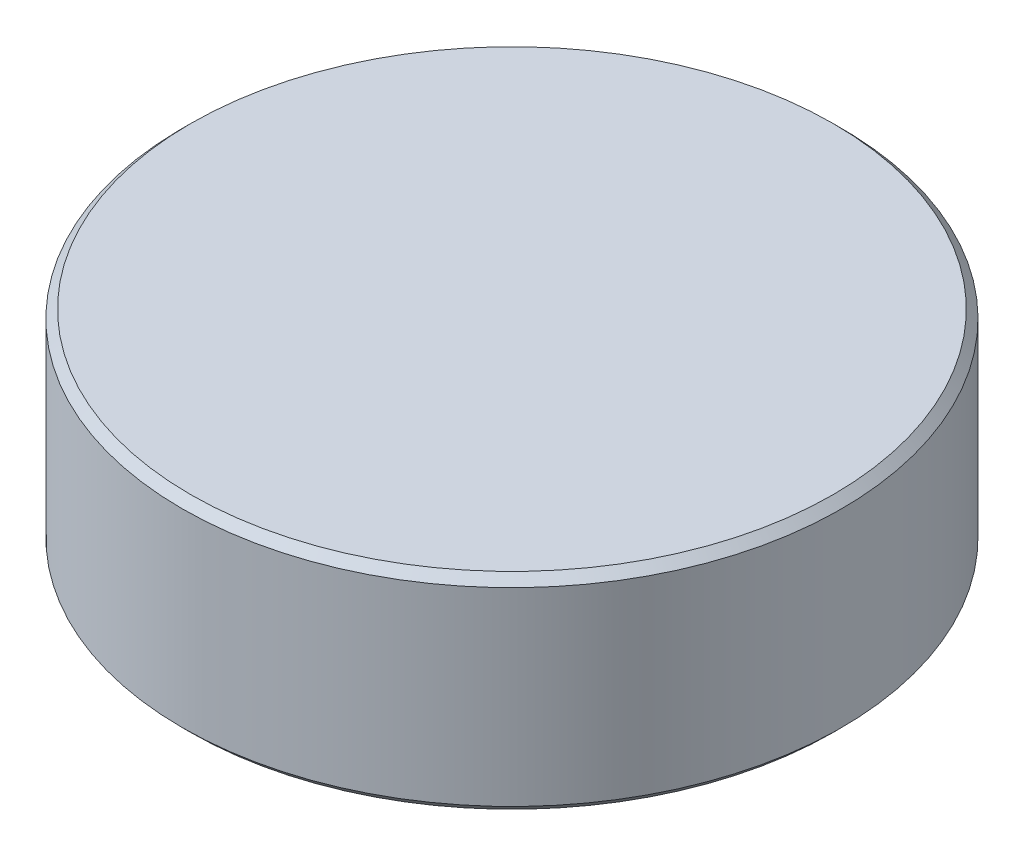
from build123d import *

# Parameters (mm, degrees)
SKETCH1_R      = 50.8
EXTRUDE1_DEPTH = 31.75
CHAMFER1_SIZE  = 1.27


with BuildPart() as part:
    # Sketch1 → Extrude1 (new body)
    with BuildSketch(Plane(origin=(0, 0, 0), x_dir=(1, 0, 0), z_dir=(0, 1, 0))):
        with Locations(Location((0, 0, 0), (0, 0, 270))):
            Circle(SKETCH1_R)
    extrude(amount=EXTRUDE1_DEPTH)

    # Chamfer1
    chamfer1_edges = [part.edges().sort_by_distance(p)[0] for p in [
        (0, 0, -50.8),
        (0, 31.75, -50.8),
    ]]
    chamfer(chamfer1_edges, length=CHAMFER1_SIZE)


solid = part.part
